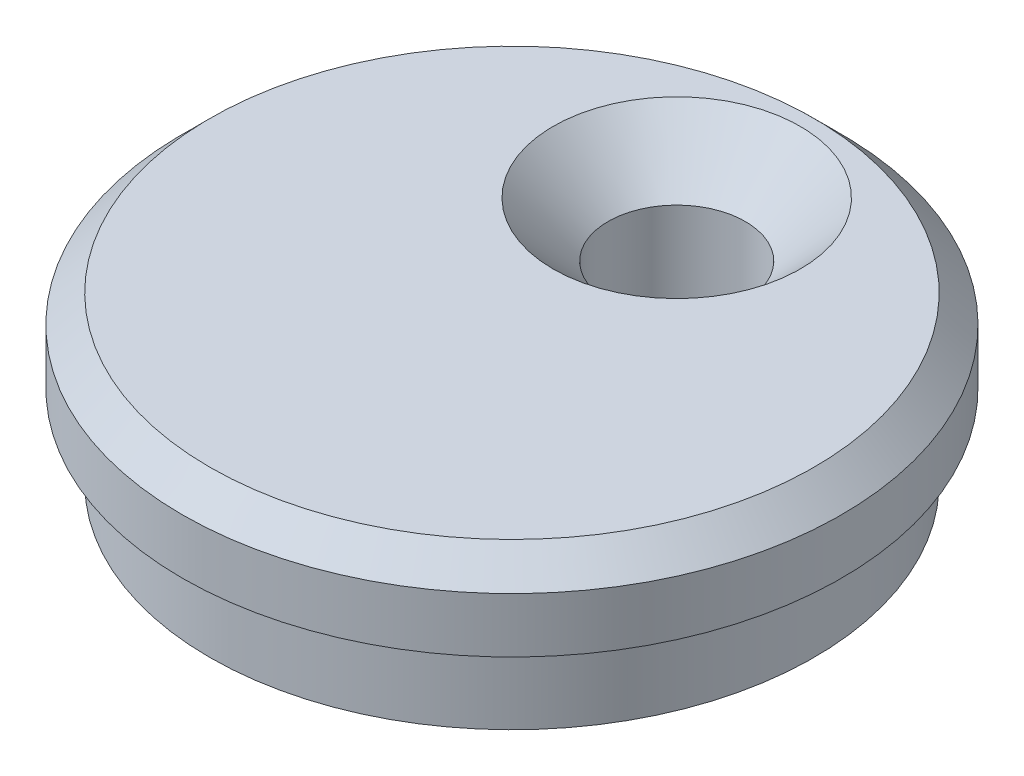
from build123d import *

# Parameters (mm, degrees)
SKETCH1_R                                           = 11
EXTRUDE1_DEPTH                                      = 3
SKETCH2_R                                           = 12
EXTRUDE2_DEPTH                                      = 3
CHAMFER1_SIZE                                       = 1
CSK_FOR_M5_COUNTERSUNK_FLAT_HEAD_SCREW1_D           = 5
CSK_FOR_M5_COUNTERSUNK_FLAT_HEAD_SCREW1_CSINK_D     = 9
CSK_FOR_M5_COUNTERSUNK_FLAT_HEAD_SCREW1_CSINK_ANGLE = 90


with BuildPart() as part:
    # Sketch1 → Extrude1 (new body)
    with BuildSketch(Plane(origin=(0, 0, 0), x_dir=(1, 0, 0), z_dir=(0, 1, 0))):
        with Locations(Location((0, 0, 0), (0, 0, 270))):
            Circle(SKETCH1_R)
    extrude(amount=EXTRUDE1_DEPTH)

    # Sketch2 → Extrude2 (add)
    with BuildSketch(Plane(origin=(0, 3, 0), x_dir=(1, 0, 0), z_dir=(0, 1, 0))):
        with Locations(Location((0, 0, 0), (0, 0, 270))):
            Circle(SKETCH2_R)
    extrude(amount=EXTRUDE2_DEPTH)

    # Chamfer1
    chamfer1_edges = [part.edges().sort_by_distance(p)[0] for p in [
        (0, 6, -12),
    ]]
    chamfer(chamfer1_edges, length=CHAMFER1_SIZE)

    # CSK for M5 Countersunk Flat Head Screw1 (through all)
    with Locations(Plane(origin=(0, 6, -6), x_dir=(0, 0, 1), z_dir=(0, 1, 0))):
        with Locations((0, 0)):
            CounterSinkHole(CSK_FOR_M5_COUNTERSUNK_FLAT_HEAD_SCREW1_D / 2, CSK_FOR_M5_COUNTERSUNK_FLAT_HEAD_SCREW1_CSINK_D / 2, counter_sink_angle=CSK_FOR_M5_COUNTERSUNK_FLAT_HEAD_SCREW1_CSINK_ANGLE)


solid = part.part
